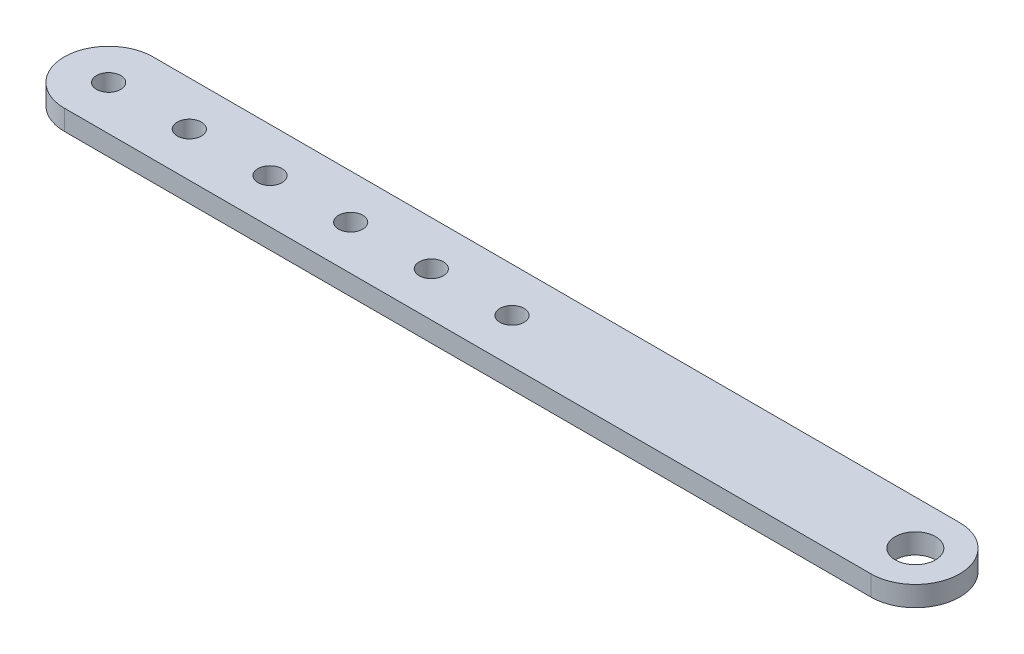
from build123d import *

# Parameters (mm, degrees)
BASE_EXTRUDE_DEPTH = 5
SKETCH3_R          = 3
CUT_EXTRUDE1_DEPTH = 212.345688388
LPATTERN1_COUNT    = 6
LPATTERN1_PITCH    = 20
SKETCH5_R          = 5
CUT_EXTRUDE2_DEPTH = 212.345688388


with BuildPart() as part:
    # Sketch2 → Base-Extrude (new body)
    with BuildSketch(Plane(origin=(0, 0, 0), x_dir=(1, 0, 0), z_dir=(0, 1, 0))):
        with BuildLine():
            Line((0, 11), (200, 11))
            ThreePointArc((200, 11), (211, 0), (200, -11))
            Line((200, -11), (0, -11))
            ThreePointArc((0, -11), (-11, 0), (0, 11))
        make_face()
    extrude(amount=BASE_EXTRUDE_DEPTH)

    # Sketch3 → Cut-Extrude1 (cut, through all)
    with BuildSketch(Plane(origin=(0, 5, 0), x_dir=(-1, 0, 0), z_dir=(0, 1, 0))):
        with Locations(Location((0, 0, 0), (0, 0, 90))):
            Circle(SKETCH3_R)
    cut_extrude1 = extrude(amount=-CUT_EXTRUDE1_DEPTH, mode=Mode.SUBTRACT)

    # LPattern1: Cut-Extrude1 ×6
    with Locations(*[(i * LPATTERN1_PITCH, 0, 0) for i in range(1, LPATTERN1_COUNT)]):
        add(cut_extrude1, mode=Mode.SUBTRACT)

    # Sketch5 → Cut-Extrude2 (cut, through all)
    with BuildSketch(Plane(origin=(0, 5, 0), x_dir=(-1, 0, 0), z_dir=(0, 1, 0))):
        with Locations(Location((-200, 0, 0), (0, 0, 90))):
            Circle(SKETCH5_R)
    extrude(amount=-CUT_EXTRUDE2_DEPTH, mode=Mode.SUBTRACT)


solid = part.part
